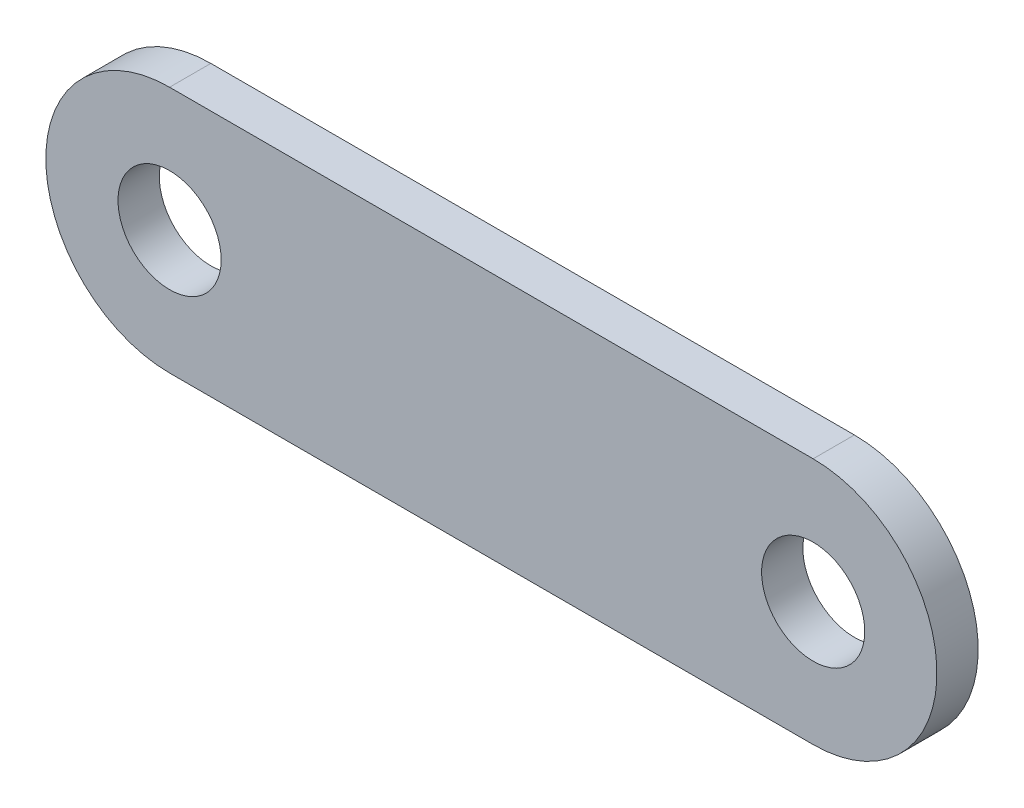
from build123d import *

# Parameters (mm, degrees)
SKETCH1_R      = 3.175
EXTRUDE1_DEPTH = 2.54


with BuildPart() as part:
    # Sketch1 → Extrude1 (new body)
    with BuildSketch(Plane.XY):
        with BuildLine():
            Line((0, 7.62), (39.624, 7.62))
            ThreePointArc((39.624, 7.62), (47.244, 0), (39.624, -7.62))
            Line((39.624, -7.62), (0, -7.62))
            ThreePointArc((0, -7.62), (-7.62, 0), (0, 7.62))
        make_face()
        Circle(SKETCH1_R, mode=Mode.SUBTRACT)
        with Locations((39.624, 0)):
            Circle(SKETCH1_R, mode=Mode.SUBTRACT)
    extrude(amount=EXTRUDE1_DEPTH)


solid = part.part
